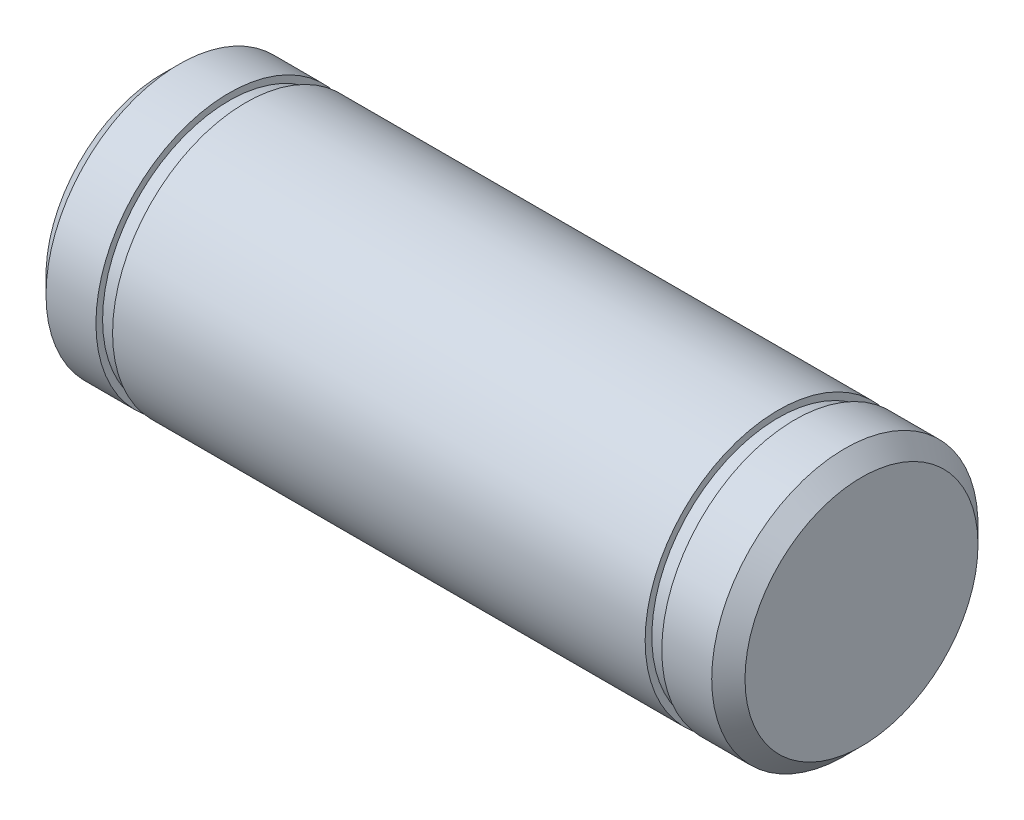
from build123d import *

# Parameters (mm, degrees)
SKETCH1_R           = 2
BOSS_EXTRUDE1_DEPTH = 10.5
CUT_EXTRUDE2_START  = -1
SKETCH2_R           = 2.498108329
SKETCH2_R_2         = 1.9
CUT_EXTRUDE2_DEPTH  = 0.25
CUT_EXTRUDE3_START  = -1.25
SKETCH3_R           = 2.5
SKETCH3_R_2         = 1.9
CUT_EXTRUDE3_DEPTH  = 0.25
CHAMFER1_SIZE       = 0.25


with BuildPart() as part:
    # Sketch1 → Boss-Extrude1 (new body)
    with BuildSketch(Plane(origin=(0, 0, 0), x_dir=(0, 0, -1), z_dir=(1, 0, 0))):
        with Locations(Location((0, 0, 0), (0, 0, 180))):
            Circle(SKETCH1_R)
    extrude(amount=BOSS_EXTRUDE1_DEPTH)

    # Sketch2 → Cut-Extrude2 (cut)
    with BuildSketch(Plane(origin=(10.5, 0, 0), x_dir=(0, 0, -1), z_dir=(1, 0, 0)).offset(CUT_EXTRUDE2_START)):
        Circle(SKETCH2_R)
        Circle(SKETCH2_R_2, mode=Mode.SUBTRACT)
    extrude(amount=-CUT_EXTRUDE2_DEPTH, mode=Mode.SUBTRACT)

    # Sketch3 → Cut-Extrude3 (cut)
    with BuildSketch(Plane.ZY.offset(CUT_EXTRUDE3_START)):
        Circle(SKETCH3_R)
        with Locations(Location((0, 0, 0), (0, 0, 180))):
            Circle(SKETCH3_R_2, mode=Mode.SUBTRACT)
    extrude(amount=CUT_EXTRUDE3_DEPTH, mode=Mode.SUBTRACT)

    # Chamfer1
    chamfer1_edges = [part.edges().sort_by_distance(p)[0] for p in [
        (0, 0, -2),
        (10.5, 0, -2),
    ]]
    chamfer(chamfer1_edges, length=CHAMFER1_SIZE)


solid = part.part
